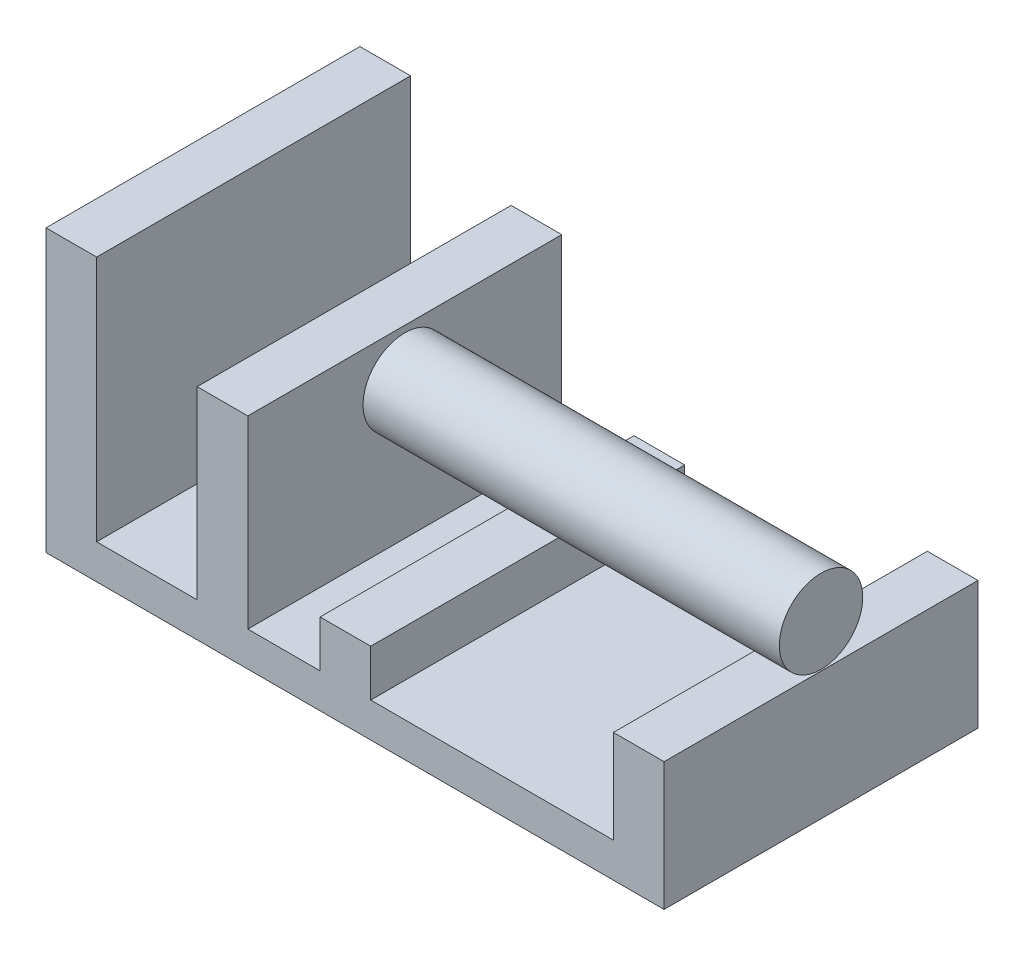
ISO-10303-21;
HEADER;
FILE_DESCRIPTION(('STEP AP214'),'2;1');
FILE_NAME('part.step','',(''),(''),'','','');
FILE_SCHEMA(('AUTOMOTIVE_DESIGN { 1 0 10303 214 1 1 1 1 }'));
ENDSEC;
DATA;
#1=APPLICATION_CONTEXT('core data for automotive mechanical design processes');
#2=APPLICATION_PROTOCOL_DEFINITION('international standard','automotive_design',2000,#1);
#3=PRODUCT_CONTEXT('',#1,'mechanical');
#4=PRODUCT('Part','Part','',(#3));
#5=PRODUCT_RELATED_PRODUCT_CATEGORY('part','',(#4));
#6=PRODUCT_DEFINITION_FORMATION('','',#4);
#7=PRODUCT_DEFINITION_CONTEXT('part definition',#1,'design');
#8=PRODUCT_DEFINITION('design','',#6,#7);
#9=PRODUCT_DEFINITION_SHAPE('','',#8);
#10=(LENGTH_UNIT() NAMED_UNIT(*) SI_UNIT(.MILLI.,.METRE.));
#11=(NAMED_UNIT(*) PLANE_ANGLE_UNIT() SI_UNIT($,.RADIAN.));
#12=(NAMED_UNIT(*) SI_UNIT($,.STERADIAN.) SOLID_ANGLE_UNIT());
#13=UNCERTAINTY_MEASURE_WITH_UNIT(LENGTH_MEASURE(1.E-05),#10,'distance_accuracy_value','');
#14=(GEOMETRIC_REPRESENTATION_CONTEXT(3) GLOBAL_UNCERTAINTY_ASSIGNED_CONTEXT((#13)) GLOBAL_UNIT_ASSIGNED_CONTEXT((#10,
#11,#12)) REPRESENTATION_CONTEXT('',''));
#15=CARTESIAN_POINT('',(0.,0.,0.));
#16=DIRECTION('',(0.,0.,1.));
#17=DIRECTION('',(1.,0.,0.));
#18=AXIS2_PLACEMENT_3D('',#15,#16,#17);
#19=CARTESIAN_POINT('',(12.1527001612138,67.4845492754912,37.6594941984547));
#20=DIRECTION('',(0.,-1.,0.));
#21=DIRECTION('',(0.,0.,-1.));
#22=AXIS2_PLACEMENT_3D('',#19,#20,#21);
#23=PLANE('',#22);
#24=DIRECTION('',(-1.,0.,0.));
#25=VECTOR('',#24,1.);
#26=CARTESIAN_POINT('',(12.1527001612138,67.4845492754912,-37.6594941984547));
#27=LINE('',#26,#25);
#28=CARTESIAN_POINT('',(12.1527001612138,67.4845492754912,-37.6594941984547));
#29=VERTEX_POINT('',#28);
#30=CARTESIAN_POINT('',(0.,67.4845492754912,-37.6594941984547));
#31=VERTEX_POINT('',#30);
#32=EDGE_CURVE('E148',#29,#31,#27,.T.);
#33=ORIENTED_EDGE('',*,*,#32,.T.);
#34=DIRECTION('',(0.,0.,-1.));
#35=VECTOR('',#34,1.);
#36=CARTESIAN_POINT('',(0.,67.4845492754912,37.6594941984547));
#37=LINE('',#36,#35);
#38=CARTESIAN_POINT('',(0.,67.4845492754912,37.6594941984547));
#39=VERTEX_POINT('',#38);
#40=EDGE_CURVE('E11',#39,#31,#37,.T.);
#41=ORIENTED_EDGE('',*,*,#40,.F.);
#42=DIRECTION('',(-1.,0.,0.));
#43=VECTOR('',#42,1.);
#44=CARTESIAN_POINT('',(12.1527001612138,67.4845492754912,37.6594941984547));
#45=LINE('',#44,#43);
#46=CARTESIAN_POINT('',(12.1527001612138,67.4845492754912,37.6594941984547));
#47=VERTEX_POINT('',#46);
#48=EDGE_CURVE('E196',#47,#39,#45,.T.);
#49=ORIENTED_EDGE('',*,*,#48,.F.);
#50=DIRECTION('',(0.,0.,-1.));
#51=VECTOR('',#50,1.);
#52=CARTESIAN_POINT('',(12.1527001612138,67.4845492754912,37.6594941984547));
#53=LINE('',#52,#51);
#54=EDGE_CURVE('E161',#47,#29,#53,.T.);
#55=ORIENTED_EDGE('',*,*,#54,.T.);
#56=EDGE_LOOP('',(#33,#41,#49,#55));
#57=FACE_BOUND('',#56,.T.);
#58=ADVANCED_FACE('F32',(#57),#23,.F.);
#59=CARTESIAN_POINT('',(0.,67.4845492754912,37.6594941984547));
#60=DIRECTION('',(1.,0.,0.));
#61=DIRECTION('',(0.,0.,-1.));
#62=AXIS2_PLACEMENT_3D('',#59,#60,#61);
#63=PLANE('',#62);
#64=DIRECTION('',(0.,-1.,0.));
#65=VECTOR('',#64,1.);
#66=CARTESIAN_POINT('',(0.,67.4845492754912,-37.6594941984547));
#67=LINE('',#66,#65);
#68=CARTESIAN_POINT('',(0.,0.,-37.6594941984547));
#69=VERTEX_POINT('',#68);
#70=EDGE_CURVE('E144',#31,#69,#67,.T.);
#71=ORIENTED_EDGE('',*,*,#70,.T.);
#72=DIRECTION('',(0.,0.,-1.));
#73=VECTOR('',#72,1.);
#74=CARTESIAN_POINT('',(0.,0.,37.6594941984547));
#75=LINE('',#74,#73);
#76=CARTESIAN_POINT('',(0.,0.,37.6594941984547));
#77=VERTEX_POINT('',#76);
#78=EDGE_CURVE('E39',#77,#69,#75,.T.);
#79=ORIENTED_EDGE('',*,*,#78,.F.);
#80=DIRECTION('',(0.,-1.,0.));
#81=VECTOR('',#80,1.);
#82=CARTESIAN_POINT('',(0.,67.4845492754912,37.6594941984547));
#83=LINE('',#82,#81);
#84=EDGE_CURVE('E157',#39,#77,#83,.T.);
#85=ORIENTED_EDGE('',*,*,#84,.F.);
#86=ORIENTED_EDGE('',*,*,#40,.T.);
#87=EDGE_LOOP('',(#71,#79,#85,#86));
#88=FACE_BOUND('',#87,.T.);
#89=ADVANCED_FACE('F156',(#88),#63,.F.);
#90=CARTESIAN_POINT('',(0.,0.,37.6594941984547));
#91=DIRECTION('',(0.,1.,0.));
#92=DIRECTION('',(0.,0.,1.));
#93=AXIS2_PLACEMENT_3D('',#90,#91,#92);
#94=PLANE('',#93);
#95=DIRECTION('',(1.,0.,0.));
#96=VECTOR('',#95,1.);
#97=CARTESIAN_POINT('',(0.,0.,-37.6594941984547));
#98=LINE('',#97,#96);
#99=CARTESIAN_POINT('',(148.290313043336,0.,-37.6594941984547));
#100=VERTEX_POINT('',#99);
#101=EDGE_CURVE('E150',#69,#100,#98,.T.);
#102=ORIENTED_EDGE('',*,*,#101,.T.);
#103=DIRECTION('',(0.,0.,-1.));
#104=VECTOR('',#103,1.);
#105=CARTESIAN_POINT('',(148.290313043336,0.,37.6594941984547));
#106=LINE('',#105,#104);
#107=CARTESIAN_POINT('',(148.290313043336,0.,37.6594941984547));
#108=VERTEX_POINT('',#107);
#109=EDGE_CURVE('E262',#108,#100,#106,.T.);
#110=ORIENTED_EDGE('',*,*,#109,.F.);
#111=DIRECTION('',(1.,0.,0.));
#112=VECTOR('',#111,1.);
#113=CARTESIAN_POINT('',(0.,0.,37.6594941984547));
#114=LINE('',#113,#112);
#115=EDGE_CURVE('E199',#77,#108,#114,.T.);
#116=ORIENTED_EDGE('',*,*,#115,.F.);
#117=ORIENTED_EDGE('',*,*,#78,.T.);
#118=EDGE_LOOP('',(#102,#110,#116,#117));
#119=FACE_BOUND('',#118,.T.);
#120=ADVANCED_FACE('F266',(#119),#94,.F.);
#121=CARTESIAN_POINT('',(148.290313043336,0.,37.6594941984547));
#122=DIRECTION('',(-1.,0.,0.));
#123=DIRECTION('',(0.,0.,1.));
#124=AXIS2_PLACEMENT_3D('',#121,#122,#123);
#125=PLANE('',#124);
#126=DIRECTION('',(0.,1.,0.));
#127=VECTOR('',#126,1.);
#128=CARTESIAN_POINT('',(148.290313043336,0.,-37.6594941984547));
#129=LINE('',#128,#127);
#130=CARTESIAN_POINT('',(148.290313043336,30.7015583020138,-37.6594941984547));
#131=VERTEX_POINT('',#130);
#132=EDGE_CURVE('E170',#100,#131,#129,.T.);
#133=ORIENTED_EDGE('',*,*,#132,.T.);
#134=DIRECTION('',(0.,0.,-1.));
#135=VECTOR('',#134,1.);
#136=CARTESIAN_POINT('',(148.290313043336,30.7015583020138,37.6594941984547));
#137=LINE('',#136,#135);
#138=CARTESIAN_POINT('',(148.290313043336,30.7015583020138,37.6594941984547));
#139=VERTEX_POINT('',#138);
#140=EDGE_CURVE('E259',#139,#131,#137,.T.);
#141=ORIENTED_EDGE('',*,*,#140,.F.);
#142=DIRECTION('',(0.,1.,0.));
#143=VECTOR('',#142,1.);
#144=CARTESIAN_POINT('',(148.290313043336,0.,37.6594941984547));
#145=LINE('',#144,#143);
#146=EDGE_CURVE('E201',#108,#139,#145,.T.);
#147=ORIENTED_EDGE('',*,*,#146,.F.);
#148=ORIENTED_EDGE('',*,*,#109,.T.);
#149=EDGE_LOOP('',(#133,#141,#147,#148));
#150=FACE_BOUND('',#149,.T.);
#151=ADVANCED_FACE('F274',(#150),#125,.F.);
#152=CARTESIAN_POINT('',(148.290313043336,30.7015583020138,37.6594941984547));
#153=DIRECTION('',(0.,-1.,0.));
#154=DIRECTION('',(0.,0.,-1.));
#155=AXIS2_PLACEMENT_3D('',#152,#153,#154);
#156=PLANE('',#155);
#157=DIRECTION('',(-1.,0.,0.));
#158=VECTOR('',#157,1.);
#159=CARTESIAN_POINT('',(148.290313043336,30.7015583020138,-37.6594941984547));
#160=LINE('',#159,#158);
#161=CARTESIAN_POINT('',(136.137612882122,30.7015583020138,-37.6594941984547));
#162=VERTEX_POINT('',#161);
#163=EDGE_CURVE('E172',#131,#162,#160,.T.);
#164=ORIENTED_EDGE('',*,*,#163,.T.);
#165=DIRECTION('',(0.,0.,-1.));
#166=VECTOR('',#165,1.);
#167=CARTESIAN_POINT('',(136.137612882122,30.7015583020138,37.6594941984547));
#168=LINE('',#167,#166);
#169=CARTESIAN_POINT('',(136.137612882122,30.7015583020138,37.6594941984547));
#170=VERTEX_POINT('',#169);
#171=EDGE_CURVE('E256',#170,#162,#168,.T.);
#172=ORIENTED_EDGE('',*,*,#171,.F.);
#173=DIRECTION('',(-1.,0.,0.));
#174=VECTOR('',#173,1.);
#175=CARTESIAN_POINT('',(148.290313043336,30.7015583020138,37.6594941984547));
#176=LINE('',#175,#174);
#177=EDGE_CURVE('E203',#139,#170,#176,.T.);
#178=ORIENTED_EDGE('',*,*,#177,.F.);
#179=ORIENTED_EDGE('',*,*,#140,.T.);
#180=EDGE_LOOP('',(#164,#172,#178,#179));
#181=FACE_BOUND('',#180,.T.);
#182=ADVANCED_FACE('F277',(#181),#156,.F.);
#183=CARTESIAN_POINT('',(136.137612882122,30.7015583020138,37.6594941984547));
#184=DIRECTION('',(1.,0.,0.));
#185=DIRECTION('',(0.,0.,-1.));
#186=AXIS2_PLACEMENT_3D('',#183,#184,#185);
#187=PLANE('',#186);
#188=DIRECTION('',(0.,-1.,0.));
#189=VECTOR('',#188,1.);
#190=CARTESIAN_POINT('',(136.137612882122,30.7015583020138,-37.6594941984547));
#191=LINE('',#190,#189);
#192=CARTESIAN_POINT('',(136.137612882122,8.31500537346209,-37.6594941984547));
#193=VERTEX_POINT('',#192);
#194=EDGE_CURVE('E174',#162,#193,#191,.T.);
#195=ORIENTED_EDGE('',*,*,#194,.T.);
#196=DIRECTION('',(0.,0.,-1.));
#197=VECTOR('',#196,1.);
#198=CARTESIAN_POINT('',(136.137612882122,8.31500537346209,37.6594941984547));
#199=LINE('',#198,#197);
#200=CARTESIAN_POINT('',(136.137612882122,8.31500537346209,37.6594941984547));
#201=VERTEX_POINT('',#200);
#202=EDGE_CURVE('E253',#201,#193,#199,.T.);
#203=ORIENTED_EDGE('',*,*,#202,.F.);
#204=DIRECTION('',(0.,-1.,0.));
#205=VECTOR('',#204,1.);
#206=CARTESIAN_POINT('',(136.137612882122,30.7015583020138,37.6594941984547));
#207=LINE('',#206,#205);
#208=EDGE_CURVE('E205',#170,#201,#207,.T.);
#209=ORIENTED_EDGE('',*,*,#208,.F.);
#210=ORIENTED_EDGE('',*,*,#171,.T.);
#211=EDGE_LOOP('',(#195,#203,#209,#210));
#212=FACE_BOUND('',#211,.T.);
#213=ADVANCED_FACE('F282',(#212),#187,.F.);
#214=CARTESIAN_POINT('',(136.137612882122,8.31500537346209,37.6594941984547));
#215=DIRECTION('',(0.,-1.,0.));
#216=DIRECTION('',(1.,0.,0.));
#217=AXIS2_PLACEMENT_3D('',#214,#215,#216);
#218=PLANE('',#217);
#219=DIRECTION('',(-1.,0.,0.));
#220=VECTOR('',#219,1.);
#221=CARTESIAN_POINT('',(136.137612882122,8.31500537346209,-37.6594941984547));
#222=LINE('',#221,#220);
#223=CARTESIAN_POINT('',(77.9104355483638,8.31500537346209,-37.6594941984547));
#224=VERTEX_POINT('',#223);
#225=EDGE_CURVE('E176',#193,#224,#222,.T.);
#226=ORIENTED_EDGE('',*,*,#225,.T.);
#227=DIRECTION('',(0.,0.,-1.));
#228=VECTOR('',#227,1.);
#229=CARTESIAN_POINT('',(77.9104355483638,8.31500537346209,37.6594941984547));
#230=LINE('',#229,#228);
#231=CARTESIAN_POINT('',(77.9104355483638,8.31500537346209,37.6594941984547));
#232=VERTEX_POINT('',#231);
#233=EDGE_CURVE('E250',#232,#224,#230,.T.);
#234=ORIENTED_EDGE('',*,*,#233,.F.);
#235=DIRECTION('',(-1.,0.,0.));
#236=VECTOR('',#235,1.);
#237=CARTESIAN_POINT('',(136.137612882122,8.31500537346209,37.6594941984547));
#238=LINE('',#237,#236);
#239=EDGE_CURVE('E207',#201,#232,#238,.T.);
#240=ORIENTED_EDGE('',*,*,#239,.F.);
#241=ORIENTED_EDGE('',*,*,#202,.T.);
#242=EDGE_LOOP('',(#226,#234,#240,#241));
#243=FACE_BOUND('',#242,.T.);
#244=ADVANCED_FACE('F288',(#243),#218,.F.);
#245=CARTESIAN_POINT('',(77.9104355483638,8.31500537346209,37.6594941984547));
#246=DIRECTION('',(-1.,0.,0.));
#247=DIRECTION('',(0.,0.,1.));
#248=AXIS2_PLACEMENT_3D('',#245,#246,#247);
#249=PLANE('',#248);
#250=DIRECTION('',(0.,1.,0.));
#251=VECTOR('',#250,1.);
#252=CARTESIAN_POINT('',(77.9104355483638,8.31500537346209,-37.6594941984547));
#253=LINE('',#252,#251);
#254=CARTESIAN_POINT('',(77.9104355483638,19.5082818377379,-37.6594941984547));
#255=VERTEX_POINT('',#254);
#256=EDGE_CURVE('E178',#224,#255,#253,.T.);
#257=ORIENTED_EDGE('',*,*,#256,.T.);
#258=DIRECTION('',(0.,0.,-1.));
#259=VECTOR('',#258,1.);
#260=CARTESIAN_POINT('',(77.9104355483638,19.5082818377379,37.6594941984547));
#261=LINE('',#260,#259);
#262=CARTESIAN_POINT('',(77.9104355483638,19.5082818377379,37.6594941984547));
#263=VERTEX_POINT('',#262);
#264=EDGE_CURVE('E247',#263,#255,#261,.T.);
#265=ORIENTED_EDGE('',*,*,#264,.F.);
#266=DIRECTION('',(0.,1.,0.));
#267=VECTOR('',#266,1.);
#268=CARTESIAN_POINT('',(77.9104355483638,8.31500537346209,37.6594941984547));
#269=LINE('',#268,#267);
#270=EDGE_CURVE('E209',#232,#263,#269,.T.);
#271=ORIENTED_EDGE('',*,*,#270,.F.);
#272=ORIENTED_EDGE('',*,*,#233,.T.);
#273=EDGE_LOOP('',(#257,#265,#271,#272));
#274=FACE_BOUND('',#273,.T.);
#275=ADVANCED_FACE('F292',(#274),#249,.F.);
#276=CARTESIAN_POINT('',(77.9104355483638,19.5082818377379,37.6594941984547));
#277=DIRECTION('',(0.,-1.,0.));
#278=DIRECTION('',(0.,0.,-1.));
#279=AXIS2_PLACEMENT_3D('',#276,#277,#278);
#280=PLANE('',#279);
#281=DIRECTION('',(-1.,0.,0.));
#282=VECTOR('',#281,1.);
#283=CARTESIAN_POINT('',(77.9104355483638,19.5082818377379,-37.6594941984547));
#284=LINE('',#283,#282);
#285=CARTESIAN_POINT('',(65.75773538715,19.5082818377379,-37.6594941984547));
#286=VERTEX_POINT('',#285);
#287=EDGE_CURVE('E180',#255,#286,#284,.T.);
#288=ORIENTED_EDGE('',*,*,#287,.T.);
#289=DIRECTION('',(0.,0.,-1.));
#290=VECTOR('',#289,1.);
#291=CARTESIAN_POINT('',(65.75773538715,19.5082818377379,37.6594941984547));
#292=LINE('',#291,#290);
#293=CARTESIAN_POINT('',(65.75773538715,19.5082818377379,37.6594941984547));
#294=VERTEX_POINT('',#293);
#295=EDGE_CURVE('E244',#294,#286,#292,.T.);
#296=ORIENTED_EDGE('',*,*,#295,.F.);
#297=DIRECTION('',(-1.,0.,0.));
#298=VECTOR('',#297,1.);
#299=CARTESIAN_POINT('',(77.9104355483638,19.5082818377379,37.6594941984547));
#300=LINE('',#299,#298);
#301=EDGE_CURVE('E211',#263,#294,#300,.T.);
#302=ORIENTED_EDGE('',*,*,#301,.F.);
#303=ORIENTED_EDGE('',*,*,#264,.T.);
#304=EDGE_LOOP('',(#288,#296,#302,#303));
#305=FACE_BOUND('',#304,.T.);
#306=ADVANCED_FACE('F297',(#305),#280,.F.);
#307=CARTESIAN_POINT('',(65.75773538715,19.5082818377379,37.6594941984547));
#308=DIRECTION('',(1.,0.,0.));
#309=DIRECTION('',(0.,0.,-1.));
#310=AXIS2_PLACEMENT_3D('',#307,#308,#309);
#311=PLANE('',#310);
#312=DIRECTION('',(0.,-1.,0.));
#313=VECTOR('',#312,1.);
#314=CARTESIAN_POINT('',(65.75773538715,19.5082818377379,-37.6594941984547));
#315=LINE('',#314,#313);
#316=CARTESIAN_POINT('',(65.75773538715,8.31500537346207,-37.6594941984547));
#317=VERTEX_POINT('',#316);
#318=EDGE_CURVE('E182',#286,#317,#315,.T.);
#319=ORIENTED_EDGE('',*,*,#318,.T.);
#320=DIRECTION('',(0.,0.,-1.));
#321=VECTOR('',#320,1.);
#322=CARTESIAN_POINT('',(65.75773538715,8.31500537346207,37.6594941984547));
#323=LINE('',#322,#321);
#324=CARTESIAN_POINT('',(65.75773538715,8.31500537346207,37.6594941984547));
#325=VERTEX_POINT('',#324);
#326=EDGE_CURVE('E241',#325,#317,#323,.T.);
#327=ORIENTED_EDGE('',*,*,#326,.F.);
#328=DIRECTION('',(0.,-1.,0.));
#329=VECTOR('',#328,1.);
#330=CARTESIAN_POINT('',(65.75773538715,19.5082818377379,37.6594941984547));
#331=LINE('',#330,#329);
#332=EDGE_CURVE('E213',#294,#325,#331,.T.);
#333=ORIENTED_EDGE('',*,*,#332,.F.);
#334=ORIENTED_EDGE('',*,*,#295,.T.);
#335=EDGE_LOOP('',(#319,#327,#333,#334));
#336=FACE_BOUND('',#335,.T.);
#337=ADVANCED_FACE('F303',(#336),#311,.F.);
#338=CARTESIAN_POINT('',(65.75773538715,8.31500537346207,37.6594941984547));
#339=DIRECTION('',(0.,-1.,0.));
#340=DIRECTION('',(0.,0.,-1.));
#341=AXIS2_PLACEMENT_3D('',#338,#339,#340);
#342=PLANE('',#341);
#343=DIRECTION('',(-1.,0.,0.));
#344=VECTOR('',#343,1.);
#345=CARTESIAN_POINT('',(65.75773538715,8.31500537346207,-37.6594941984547));
#346=LINE('',#345,#344);
#347=CARTESIAN_POINT('',(48.4216600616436,8.31500537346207,-37.6594941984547));
#348=VERTEX_POINT('',#347);
#349=EDGE_CURVE('E184',#317,#348,#346,.T.);
#350=ORIENTED_EDGE('',*,*,#349,.T.);
#351=DIRECTION('',(0.,0.,-1.));
#352=VECTOR('',#351,1.);
#353=CARTESIAN_POINT('',(48.4216600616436,8.31500537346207,37.6594941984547));
#354=LINE('',#353,#352);
#355=CARTESIAN_POINT('',(48.4216600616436,8.31500537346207,37.6594941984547));
#356=VERTEX_POINT('',#355);
#357=EDGE_CURVE('E238',#356,#348,#354,.T.);
#358=ORIENTED_EDGE('',*,*,#357,.F.);
#359=DIRECTION('',(-1.,0.,0.));
#360=VECTOR('',#359,1.);
#361=CARTESIAN_POINT('',(65.75773538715,8.31500537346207,37.6594941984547));
#362=LINE('',#361,#360);
#363=EDGE_CURVE('E215',#325,#356,#362,.T.);
#364=ORIENTED_EDGE('',*,*,#363,.F.);
#365=ORIENTED_EDGE('',*,*,#326,.T.);
#366=EDGE_LOOP('',(#350,#358,#364,#365));
#367=FACE_BOUND('',#366,.T.);
#368=ADVANCED_FACE('F307',(#367),#342,.F.);
#369=CARTESIAN_POINT('',(48.4216600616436,8.31500537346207,37.6594941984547));
#370=DIRECTION('',(-1.,0.,0.));
#371=DIRECTION('',(0.,0.,1.));
#372=AXIS2_PLACEMENT_3D('',#369,#370,#371);
#373=PLANE('',#372);
#374=CARTESIAN_POINT('',(48.4216600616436,41.0397914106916,0.));
#375=DIRECTION('',(1.,0.,0.));
#376=DIRECTION('',(0.,0.,-1.));
#377=AXIS2_PLACEMENT_3D('',#374,#375,#376);
#378=CIRCLE('',#377,10.012110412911);
#379=CARTESIAN_POINT('',(48.4216600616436,41.0397914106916,-10.012110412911));
#380=VERTEX_POINT('',#379);
#381=EDGE_CURVE('E162',#380,#380,#378,.T.);
#382=ORIENTED_EDGE('',*,*,#381,.F.);
#383=EDGE_LOOP('',(#382));
#384=FACE_BOUND('',#383,.T.);
#385=DIRECTION('',(0.,1.,0.));
#386=VECTOR('',#385,1.);
#387=CARTESIAN_POINT('',(48.4216600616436,8.31500537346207,-37.6594941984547));
#388=LINE('',#387,#386);
#389=CARTESIAN_POINT('',(48.4216600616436,52.6143636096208,-37.6594941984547));
#390=VERTEX_POINT('',#389);
#391=EDGE_CURVE('E186',#348,#390,#388,.T.);
#392=ORIENTED_EDGE('',*,*,#391,.T.);
#393=DIRECTION('',(0.,0.,-1.));
#394=VECTOR('',#393,1.);
#395=CARTESIAN_POINT('',(48.4216600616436,52.6143636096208,37.6594941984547));
#396=LINE('',#395,#394);
#397=CARTESIAN_POINT('',(48.4216600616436,52.6143636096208,37.6594941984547));
#398=VERTEX_POINT('',#397);
#399=EDGE_CURVE('E235',#398,#390,#396,.T.);
#400=ORIENTED_EDGE('',*,*,#399,.F.);
#401=DIRECTION('',(0.,1.,0.));
#402=VECTOR('',#401,1.);
#403=CARTESIAN_POINT('',(48.4216600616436,8.31500537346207,37.6594941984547));
#404=LINE('',#403,#402);
#405=EDGE_CURVE('E217',#356,#398,#404,.T.);
#406=ORIENTED_EDGE('',*,*,#405,.F.);
#407=ORIENTED_EDGE('',*,*,#357,.T.);
#408=EDGE_LOOP('',(#392,#400,#406,#407));
#409=FACE_BOUND('',#408,.T.);
#410=ADVANCED_FACE('F312',(#384,#409),#373,.F.);
#411=CARTESIAN_POINT('',(48.4216600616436,52.6143636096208,37.6594941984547));
#412=DIRECTION('',(0.,-1.,0.));
#413=DIRECTION('',(1.,0.,0.));
#414=AXIS2_PLACEMENT_3D('',#411,#412,#413);
#415=PLANE('',#414);
#416=DIRECTION('',(-1.,0.,0.));
#417=VECTOR('',#416,1.);
#418=CARTESIAN_POINT('',(48.4216600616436,52.6143636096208,-37.6594941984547));
#419=LINE('',#418,#417);
#420=CARTESIAN_POINT('',(36.2689599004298,52.6143636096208,-37.6594941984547));
#421=VERTEX_POINT('',#420);
#422=EDGE_CURVE('E188',#390,#421,#419,.T.);
#423=ORIENTED_EDGE('',*,*,#422,.T.);
#424=DIRECTION('',(0.,0.,-1.));
#425=VECTOR('',#424,1.);
#426=CARTESIAN_POINT('',(36.2689599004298,52.6143636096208,37.6594941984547));
#427=LINE('',#426,#425);
#428=CARTESIAN_POINT('',(36.2689599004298,52.6143636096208,37.6594941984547));
#429=VERTEX_POINT('',#428);
#430=EDGE_CURVE('E232',#429,#421,#427,.T.);
#431=ORIENTED_EDGE('',*,*,#430,.F.);
#432=DIRECTION('',(-1.,0.,0.));
#433=VECTOR('',#432,1.);
#434=CARTESIAN_POINT('',(48.4216600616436,52.6143636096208,37.6594941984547));
#435=LINE('',#434,#433);
#436=EDGE_CURVE('E219',#398,#429,#435,.T.);
#437=ORIENTED_EDGE('',*,*,#436,.F.);
#438=ORIENTED_EDGE('',*,*,#399,.T.);
#439=EDGE_LOOP('',(#423,#431,#437,#438));
#440=FACE_BOUND('',#439,.T.);
#441=ADVANCED_FACE('F318',(#440),#415,.F.);
#442=CARTESIAN_POINT('',(36.2689599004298,52.6143636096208,37.6594941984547));
#443=DIRECTION('',(1.,0.,0.));
#444=DIRECTION('',(0.,1.,0.));
#445=AXIS2_PLACEMENT_3D('',#442,#443,#444);
#446=PLANE('',#445);
#447=DIRECTION('',(0.,-1.,0.));
#448=VECTOR('',#447,1.);
#449=CARTESIAN_POINT('',(36.2689599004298,52.6143636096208,-37.6594941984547));
#450=LINE('',#449,#448);
#451=CARTESIAN_POINT('',(36.2689599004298,8.31500537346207,-37.6594941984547));
#452=VERTEX_POINT('',#451);
#453=EDGE_CURVE('E190',#421,#452,#450,.T.);
#454=ORIENTED_EDGE('',*,*,#453,.T.);
#455=DIRECTION('',(0.,0.,-1.));
#456=VECTOR('',#455,1.);
#457=CARTESIAN_POINT('',(36.2689599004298,8.31500537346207,37.6594941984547));
#458=LINE('',#457,#456);
#459=CARTESIAN_POINT('',(36.2689599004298,8.31500537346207,37.6594941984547));
#460=VERTEX_POINT('',#459);
#461=EDGE_CURVE('E229',#460,#452,#458,.T.);
#462=ORIENTED_EDGE('',*,*,#461,.F.);
#463=DIRECTION('',(0.,-1.,0.));
#464=VECTOR('',#463,1.);
#465=CARTESIAN_POINT('',(36.2689599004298,52.6143636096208,37.6594941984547));
#466=LINE('',#465,#464);
#467=EDGE_CURVE('E221',#429,#460,#466,.T.);
#468=ORIENTED_EDGE('',*,*,#467,.F.);
#469=ORIENTED_EDGE('',*,*,#430,.T.);
#470=EDGE_LOOP('',(#454,#462,#468,#469));
#471=FACE_BOUND('',#470,.T.);
#472=ADVANCED_FACE('F322',(#471),#446,.F.);
#473=CARTESIAN_POINT('',(36.2689599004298,8.31500537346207,37.6594941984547));
#474=DIRECTION('',(0.,-1.,0.));
#475=DIRECTION('',(0.,0.,-1.));
#476=AXIS2_PLACEMENT_3D('',#473,#474,#475);
#477=PLANE('',#476);
#478=DIRECTION('',(-1.,0.,0.));
#479=VECTOR('',#478,1.);
#480=CARTESIAN_POINT('',(36.2689599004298,8.31500537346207,-37.6594941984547));
#481=LINE('',#480,#479);
#482=CARTESIAN_POINT('',(12.1527001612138,8.31500537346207,-37.6594941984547));
#483=VERTEX_POINT('',#482);
#484=EDGE_CURVE('E192',#452,#483,#481,.T.);
#485=ORIENTED_EDGE('',*,*,#484,.T.);
#486=DIRECTION('',(0.,0.,-1.));
#487=VECTOR('',#486,1.);
#488=CARTESIAN_POINT('',(12.1527001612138,8.31500537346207,37.6594941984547));
#489=LINE('',#488,#487);
#490=CARTESIAN_POINT('',(12.1527001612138,8.31500537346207,37.6594941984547));
#491=VERTEX_POINT('',#490);
#492=EDGE_CURVE('E226',#491,#483,#489,.T.);
#493=ORIENTED_EDGE('',*,*,#492,.F.);
#494=DIRECTION('',(-1.,0.,0.));
#495=VECTOR('',#494,1.);
#496=CARTESIAN_POINT('',(36.2689599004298,8.31500537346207,37.6594941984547));
#497=LINE('',#496,#495);
#498=EDGE_CURVE('E51',#460,#491,#497,.T.);
#499=ORIENTED_EDGE('',*,*,#498,.F.);
#500=ORIENTED_EDGE('',*,*,#461,.T.);
#501=EDGE_LOOP('',(#485,#493,#499,#500));
#502=FACE_BOUND('',#501,.T.);
#503=ADVANCED_FACE('F325',(#502),#477,.F.);
#504=CARTESIAN_POINT('',(12.1527001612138,8.31500537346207,37.6594941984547));
#505=DIRECTION('',(-1.,0.,0.));
#506=DIRECTION('',(0.,0.,1.));
#507=AXIS2_PLACEMENT_3D('',#504,#505,#506);
#508=PLANE('',#507);
#509=DIRECTION('',(0.,1.,0.));
#510=VECTOR('',#509,1.);
#511=CARTESIAN_POINT('',(12.1527001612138,8.31500537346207,-37.6594941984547));
#512=LINE('',#511,#510);
#513=EDGE_CURVE('E194',#483,#29,#512,.T.);
#514=ORIENTED_EDGE('',*,*,#513,.T.);
#515=ORIENTED_EDGE('',*,*,#54,.F.);
#516=DIRECTION('',(0.,1.,0.));
#517=VECTOR('',#516,1.);
#518=CARTESIAN_POINT('',(12.1527001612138,8.31500537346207,37.6594941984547));
#519=LINE('',#518,#517);
#520=EDGE_CURVE('E46',#491,#47,#519,.T.);
#521=ORIENTED_EDGE('',*,*,#520,.F.);
#522=ORIENTED_EDGE('',*,*,#492,.T.);
#523=EDGE_LOOP('',(#514,#515,#521,#522));
#524=FACE_BOUND('',#523,.T.);
#525=ADVANCED_FACE('F327',(#524),#508,.F.);
#526=CARTESIAN_POINT('',(0.,67.4845492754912,37.6594941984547));
#527=DIRECTION('',(0.,0.,1.));
#528=DIRECTION('',(1.,0.,0.));
#529=AXIS2_PLACEMENT_3D('',#526,#527,#528);
#530=PLANE('',#529);
#531=ORIENTED_EDGE('',*,*,#48,.T.);
#532=ORIENTED_EDGE('',*,*,#84,.T.);
#533=ORIENTED_EDGE('',*,*,#115,.T.);
#534=ORIENTED_EDGE('',*,*,#146,.T.);
#535=ORIENTED_EDGE('',*,*,#177,.T.);
#536=ORIENTED_EDGE('',*,*,#208,.T.);
#537=ORIENTED_EDGE('',*,*,#239,.T.);
#538=ORIENTED_EDGE('',*,*,#270,.T.);
#539=ORIENTED_EDGE('',*,*,#301,.T.);
#540=ORIENTED_EDGE('',*,*,#332,.T.);
#541=ORIENTED_EDGE('',*,*,#363,.T.);
#542=ORIENTED_EDGE('',*,*,#405,.T.);
#543=ORIENTED_EDGE('',*,*,#436,.T.);
#544=ORIENTED_EDGE('',*,*,#467,.T.);
#545=ORIENTED_EDGE('',*,*,#498,.T.);
#546=ORIENTED_EDGE('',*,*,#520,.T.);
#547=EDGE_LOOP('',(#531,#532,#533,#534,#535,#536,#537,#538,#539,#540,#541,#542,#543,#544,#545,#546));
#548=FACE_BOUND('',#547,.T.);
#549=ADVANCED_FACE('F269',(#548),#530,.T.);
#550=CARTESIAN_POINT('',(0.,67.4845492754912,-37.6594941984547));
#551=DIRECTION('',(0.,0.,1.));
#552=DIRECTION('',(1.,0.,0.));
#553=AXIS2_PLACEMENT_3D('',#550,#551,#552);
#554=PLANE('',#553);
#555=ORIENTED_EDGE('',*,*,#32,.F.);
#556=ORIENTED_EDGE('',*,*,#513,.F.);
#557=ORIENTED_EDGE('',*,*,#484,.F.);
#558=ORIENTED_EDGE('',*,*,#453,.F.);
#559=ORIENTED_EDGE('',*,*,#422,.F.);
#560=ORIENTED_EDGE('',*,*,#391,.F.);
#561=ORIENTED_EDGE('',*,*,#349,.F.);
#562=ORIENTED_EDGE('',*,*,#318,.F.);
#563=ORIENTED_EDGE('',*,*,#287,.F.);
#564=ORIENTED_EDGE('',*,*,#256,.F.);
#565=ORIENTED_EDGE('',*,*,#225,.F.);
#566=ORIENTED_EDGE('',*,*,#194,.F.);
#567=ORIENTED_EDGE('',*,*,#163,.F.);
#568=ORIENTED_EDGE('',*,*,#132,.F.);
#569=ORIENTED_EDGE('',*,*,#101,.F.);
#570=ORIENTED_EDGE('',*,*,#70,.F.);
#571=EDGE_LOOP('',(#555,#556,#557,#558,#559,#560,#561,#562,#563,#564,#565,#566,#567,#568,#569,#570));
#572=FACE_BOUND('',#571,.T.);
#573=ADVANCED_FACE('F145',(#572),#554,.F.);
#574=CARTESIAN_POINT('',(48.4216600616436,41.0397914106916,0.));
#575=DIRECTION('',(1.,0.,0.));
#576=DIRECTION('',(0.,0.,-1.));
#577=AXIS2_PLACEMENT_3D('',#574,#575,#576);
#578=CYLINDRICAL_SURFACE('',#577,10.012110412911);
#579=CARTESIAN_POINT('',(148.290313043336,41.0397914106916,0.));
#580=DIRECTION('',(1.,0.,0.));
#581=DIRECTION('',(0.,0.,-1.));
#582=AXIS2_PLACEMENT_3D('',#579,#580,#581);
#583=CIRCLE('',#582,10.012110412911);
#584=CARTESIAN_POINT('',(148.290313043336,41.0397914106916,-10.012110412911));
#585=VERTEX_POINT('',#584);
#586=EDGE_CURVE('E165',#585,#585,#583,.T.);
#587=CARTESIAN_POINT('',(48.4216600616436,41.0397914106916,-10.012110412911));
#588=CARTESIAN_POINT('',(49.4619585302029,41.0397914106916,-10.012110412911));
#589=CARTESIAN_POINT('',(50.5022569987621,41.0397914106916,-10.012110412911));
#590=CARTESIAN_POINT('',(52.5828539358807,41.0397914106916,-10.012110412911));
#591=CARTESIAN_POINT('',(53.62315240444,41.0397914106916,-10.012110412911));
#592=CARTESIAN_POINT('',(55.7037493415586,41.0397914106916,-10.012110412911));
#593=CARTESIAN_POINT('',(56.7440478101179,41.0397914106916,-10.012110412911));
#594=CARTESIAN_POINT('',(58.8246447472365,41.0397914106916,-10.012110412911));
#595=CARTESIAN_POINT('',(59.8649432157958,41.0397914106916,-10.012110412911));
#596=CARTESIAN_POINT('',(61.9455401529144,41.0397914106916,-10.012110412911));
#597=CARTESIAN_POINT('',(62.9858386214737,41.0397914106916,-10.012110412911));
#598=CARTESIAN_POINT('',(65.0664355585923,41.0397914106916,-10.012110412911));
#599=CARTESIAN_POINT('',(66.1067340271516,41.0397914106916,-10.012110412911));
#600=CARTESIAN_POINT('',(68.1873309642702,41.0397914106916,-10.012110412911));
#601=CARTESIAN_POINT('',(69.2276294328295,41.0397914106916,-10.012110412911));
#602=CARTESIAN_POINT('',(71.3082263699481,41.0397914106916,-10.012110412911));
#603=CARTESIAN_POINT('',(72.3485248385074,41.0397914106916,-10.012110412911));
#604=CARTESIAN_POINT('',(74.429121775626,41.0397914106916,-10.012110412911));
#605=CARTESIAN_POINT('',(75.4694202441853,41.0397914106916,-10.012110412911));
#606=CARTESIAN_POINT('',(77.5500171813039,41.0397914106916,-10.012110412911));
#607=CARTESIAN_POINT('',(78.5903156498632,41.0397914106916,-10.012110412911));
#608=CARTESIAN_POINT('',(80.6709125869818,41.0397914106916,-10.012110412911));
#609=CARTESIAN_POINT('',(81.7112110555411,41.0397914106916,-10.012110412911));
#610=CARTESIAN_POINT('',(83.7918079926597,41.0397914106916,-10.012110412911));
#611=CARTESIAN_POINT('',(84.832106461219,41.0397914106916,-10.012110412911));
#612=CARTESIAN_POINT('',(86.9127033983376,41.0397914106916,-10.012110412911));
#613=CARTESIAN_POINT('',(87.9530018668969,41.0397914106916,-10.012110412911));
#614=CARTESIAN_POINT('',(90.0335988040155,41.0397914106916,-10.012110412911));
#615=CARTESIAN_POINT('',(91.0738972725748,41.0397914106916,-10.012110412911));
#616=CARTESIAN_POINT('',(93.1544942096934,41.0397914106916,-10.012110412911));
#617=CARTESIAN_POINT('',(94.1947926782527,41.0397914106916,-10.012110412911));
#618=CARTESIAN_POINT('',(96.2753896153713,41.0397914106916,-10.012110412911));
#619=CARTESIAN_POINT('',(97.3156880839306,41.0397914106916,-10.012110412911));
#620=CARTESIAN_POINT('',(99.3962850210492,41.0397914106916,-10.012110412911));
#621=CARTESIAN_POINT('',(100.436583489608,41.0397914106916,-10.012110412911));
#622=CARTESIAN_POINT('',(102.517180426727,41.0397914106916,-10.012110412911));
#623=CARTESIAN_POINT('',(103.557478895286,41.0397914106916,-10.012110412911));
#624=CARTESIAN_POINT('',(105.638075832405,41.0397914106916,-10.012110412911));
#625=CARTESIAN_POINT('',(106.678374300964,41.0397914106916,-10.012110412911));
#626=CARTESIAN_POINT('',(108.758971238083,41.0397914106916,-10.012110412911));
#627=CARTESIAN_POINT('',(109.799269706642,41.0397914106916,-10.012110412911));
#628=CARTESIAN_POINT('',(111.879866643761,41.0397914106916,-10.012110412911));
#629=CARTESIAN_POINT('',(112.92016511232,41.0397914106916,-10.012110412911));
#630=CARTESIAN_POINT('',(115.000762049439,41.0397914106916,-10.012110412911));
#631=CARTESIAN_POINT('',(116.041060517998,41.0397914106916,-10.012110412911));
#632=CARTESIAN_POINT('',(118.121657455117,41.0397914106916,-10.012110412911));
#633=CARTESIAN_POINT('',(119.161955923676,41.0397914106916,-10.012110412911));
#634=CARTESIAN_POINT('',(121.242552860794,41.0397914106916,-10.012110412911));
#635=CARTESIAN_POINT('',(122.282851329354,41.0397914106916,-10.012110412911));
#636=CARTESIAN_POINT('',(124.363448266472,41.0397914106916,-10.012110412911));
#637=CARTESIAN_POINT('',(125.403746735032,41.0397914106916,-10.012110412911));
#638=CARTESIAN_POINT('',(127.48434367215,41.0397914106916,-10.012110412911));
#639=CARTESIAN_POINT('',(128.524642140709,41.0397914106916,-10.012110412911));
#640=CARTESIAN_POINT('',(130.605239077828,41.0397914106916,-10.012110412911));
#641=CARTESIAN_POINT('',(131.645537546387,41.0397914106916,-10.012110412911));
#642=CARTESIAN_POINT('',(133.726134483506,41.0397914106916,-10.012110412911));
#643=CARTESIAN_POINT('',(134.766432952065,41.0397914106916,-10.012110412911));
#644=CARTESIAN_POINT('',(136.847029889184,41.0397914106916,-10.012110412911));
#645=CARTESIAN_POINT('',(137.887328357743,41.0397914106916,-10.012110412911));
#646=CARTESIAN_POINT('',(139.967925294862,41.0397914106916,-10.012110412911));
#647=CARTESIAN_POINT('',(141.008223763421,41.0397914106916,-10.012110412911));
#648=CARTESIAN_POINT('',(143.08882070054,41.0397914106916,-10.012110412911));
#649=CARTESIAN_POINT('',(144.129119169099,41.0397914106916,-10.012110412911));
#650=CARTESIAN_POINT('',(146.209716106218,41.0397914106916,-10.012110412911));
#651=CARTESIAN_POINT('',(147.250014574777,41.0397914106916,-10.012110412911));
#652=CARTESIAN_POINT('',(148.290313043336,41.0397914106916,-10.012110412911));
#653=B_SPLINE_CURVE_WITH_KNOTS('',3,(#587,#588,#589,#590,#591,#592,#593,#594,#595,#596,#597,
#598,#599,#600,#601,#602,#603,#604,#605,#606,#607,#608,#609,#610,#611,#612,#613,#614,#615,#616,
#617,#618,#619,#620,#621,#622,#623,#624,#625,#626,#627,#628,#629,#630,#631,#632,#633,#634,#635,
#636,#637,#638,#639,#640,#641,#642,#643,#644,#645,#646,#647,#648,#649,#650,#651,#652),
.UNSPECIFIED.,.F.,.F.,(4,2,2,2,2,2,2,2,2,2,2,2,2,2,2,2,2,2,2,2,2,2,2,2,2,2,2,2,2,2,2,2,4),(0.,
3.12089540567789,6.24179081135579,9.36268621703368,12.4835816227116,15.6044770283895,
18.7253724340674,21.8462678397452,24.9671632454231,28.088058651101,31.2089540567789,
34.3298494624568,37.4507448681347,40.5716402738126,43.6925356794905,46.8134310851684,
49.9343264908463,53.0552218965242,56.1761173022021,59.29701270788,62.4179081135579,
65.5388035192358,68.6596989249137,71.7805943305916,74.9014897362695,78.0223851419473,
81.1432805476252,84.2641759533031,87.3850713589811,90.5059667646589,93.6268621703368,
96.7477575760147,99.8686529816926),.UNSPECIFIED.);
#654=EDGE_CURVE('BSEAM394',#380,#585,#653,.T.);
#655=ORIENTED_EDGE('',*,*,#381,.T.);
#656=ORIENTED_EDGE('',*,*,#586,.F.);
#657=ORIENTED_EDGE('',*,*,#654,.T.);
#658=ORIENTED_EDGE('',*,*,#654,.F.);
#659=EDGE_LOOP('',(#655,#657,#656,#658));
#660=FACE_BOUND('',#659,.T.);
#661=ADVANCED_FACE('F394',(#660),#578,.T.);
#662=CARTESIAN_POINT('',(148.290313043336,41.0397914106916,0.));
#663=DIRECTION('',(1.,0.,0.));
#664=DIRECTION('',(0.,0.,-1.));
#665=AXIS2_PLACEMENT_3D('',#662,#663,#664);
#666=PLANE('',#665);
#667=ORIENTED_EDGE('',*,*,#586,.T.);
#668=EDGE_LOOP('',(#667));
#669=FACE_BOUND('',#668,.T.);
#670=ADVANCED_FACE('F411',(#669),#666,.T.);
#671=CLOSED_SHELL('',(#58,#89,#120,#151,#182,#213,#244,#275,#306,#337,#368,#410,#441,#472,#503,
#525,#549,#573,#661,#670));
#672=MANIFOLD_SOLID_BREP('B2',#671);
#673=ADVANCED_BREP_SHAPE_REPRESENTATION('',(#18,#672),#14);
#674=SHAPE_DEFINITION_REPRESENTATION(#9,#673);
ENDSEC;
END-ISO-10303-21;
